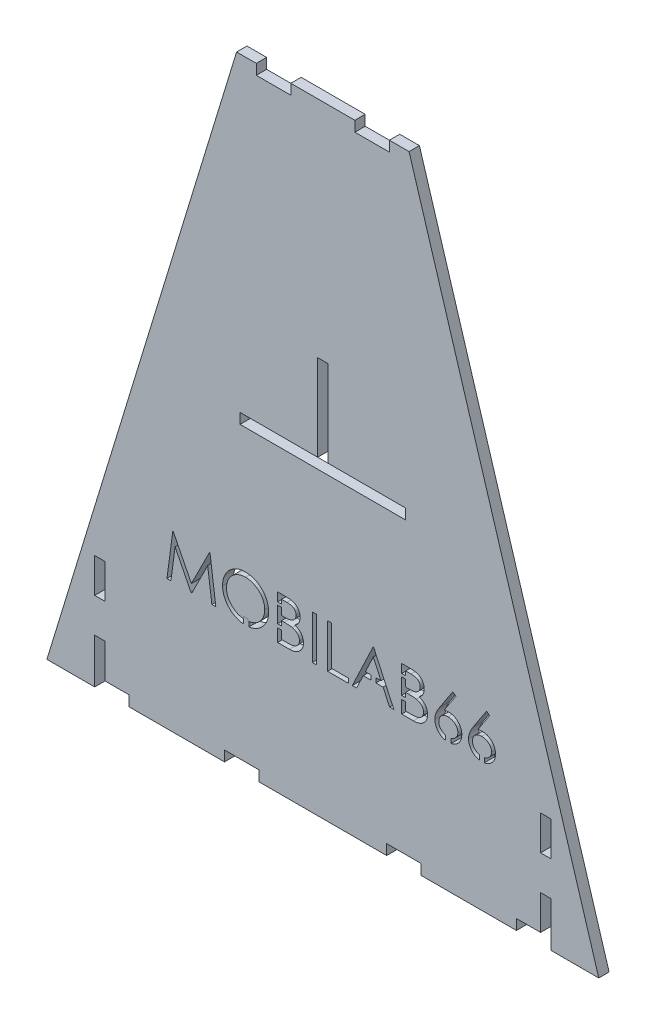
from build123d import *

# Parameters (mm, degrees)
BOSS_EXTRU_1_DEPTH      = 3
ESQUISSE2_W             = 3
ESQUISSE2_H             = 10
ENL_V_MAT_EXTRU_1_DEPTH = 202.578768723
ESQUISSE3_W             = 10
ESQUISSE3_H             = 3
ENL_V_MAT_EXTRU_2_DEPTH = 120
ESQUISSE4_W             = 1.13974359
ESQUISSE4_H             = 12.7
ENL_V_MAT_EXTRU_3_DEPTH = 3
ESQUISSE5_W             = 1.13974359
ESQUISSE5_H             = 0.825755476
ESQUISSE5_H_2           = 1.029626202
ESQUISSE5_W_2           = 1.139743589
ESQUISSE5_W_3           = 1.442397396
ESQUISSE5_H_3           = 1.302564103
ESQUISSE5_W_4           = 1.640062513
ESQUISSE5_H_4           = 2.510990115
ESQUISSE5_W_5           = 1.357293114
ESQUISSE5_W_6           = 1.601092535
ESQUISSE5_H_5           = 2.843057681
BOSS_EXTRU_2_DEPTH      = 3


with BuildPart() as part:
    # Esquisse1 → Boss.-Extru.1 (new body)
    with BuildSketch(Plane.XY):
        Polygon((-80, 5), (-66.130511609, 5), (-66.130511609, 8), (-56.130511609, 8), (-56.130511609, 5), (-28.511151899, 5), (-28.511151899, 8), (-18.511151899, 8), (-18.511151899, 5), (18.511151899, 5), (18.511151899, 8), (28.511151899, 8), (28.511151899, 5), (56.130511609, 5), (56.130511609, 8), (66.130511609, 8), (66.130511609, 5), (80, 5), (25, 185), (-25, 185), align=None)
        Polygon((-1.5, 120), (1.5, 120), (1.5, 95), (24, 95), (24, 92), (-24, 92), (-24, 95), (-1.5, 95), align=None, mode=Mode.SUBTRACT)
    extrude(amount=BOSS_EXTRU_1_DEPTH)

    # Esquisse2 → Enl_v. mat.-Extru.1 (cut, through all)
    with BuildSketch(Plane.XY.offset(3)):
        with Locations((-64.630511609, 13)):
            Rectangle(ESQUISSE2_W, ESQUISSE2_H)
        with Locations((-64.630511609, 33)):
            Rectangle(ESQUISSE2_W, ESQUISSE2_H)
        with Locations((64.630511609, 33)):
            Rectangle(ESQUISSE2_W, ESQUISSE2_H)
        with Locations((64.630511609, 13)):
            Rectangle(ESQUISSE2_W, ESQUISSE2_H)
    extrude(amount=-ENL_V_MAT_EXTRU_1_DEPTH, mode=Mode.SUBTRACT)

    # Esquisse3 → Enl_v. mat.-Extru.2 (cut)
    with BuildSketch(Plane.XY.offset(3)):
        with Locations((-14.289961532, 183.5)):
            Rectangle(ESQUISSE3_W, ESQUISSE3_H)
        with Locations((14.289961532, 183.5)):
            Rectangle(ESQUISSE3_W, ESQUISSE3_H)
    extrude(amount=-ENL_V_MAT_EXTRU_2_DEPTH, mode=Mode.SUBTRACT)

    # Esquisse4 → Enl_v. mat.-Extru.3 (cut)
    # profile 1 of 9: a face of its own
    with BuildSketch(Plane.XY.offset(3)):
        Polygon((-45.186989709, 42.699842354), (-43.510447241, 55.399842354), (-43.347626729, 55.399842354), (-38.104297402, 44.979329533), (-32.873688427, 55.399842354), (-32.708323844, 55.399842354), (-31.021605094, 42.699842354), (-32.166436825, 42.699842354), (-33.38250253, 51.838143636), (-37.966917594, 42.699842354), (-38.223868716, 42.699842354), (-42.826092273, 51.8584962), (-44.039613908, 42.699842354), align=None)
    # profile 2 of 9: a face of its own
    with BuildSketch(Plane.XY.offset(3)):
        with BuildLine():
            add(Edge.make_bspline(
                [(-22.473528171, 55.725483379), (-22.238367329, 55.719527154), (-21.776492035, 55.707828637), (-21.097677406, 55.618278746), (-20.449632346, 55.463355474), (-19.827077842, 55.257024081), (-19.23746047, 54.981781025), (-18.676342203, 54.649094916), (-18.145058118, 54.255480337), (-17.650769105, 53.803979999), (-17.198442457, 53.312731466), (-16.799931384, 52.78848305), (-16.465949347, 52.234404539), (-16.191680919, 51.652160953), (-15.976511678, 51.043069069), (-15.828034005, 50.403881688), (-15.733189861, 49.73874027), (-15.722101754, 49.285071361), (-15.716476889, 49.054930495)],
                knots=[0, 0, 0, 0, 1.065120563, 2.091984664, 3.0946048, 4.079830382, 5.057816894, 6.036188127, 7.030412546, 8.04752943, 9.064399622, 10.05169764, 11.02544977, 11.989514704, 12.962713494, 13.945757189, 14.957906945, 16, 16, 16, 16], degree=3))
            add(Edge.make_bspline(
                [(-15.716476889, 49.054930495), (-15.72210093, 48.826484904), (-15.733186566, 48.376192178), (-15.828141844, 47.715271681), (-15.977062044, 47.079942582), (-16.189682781, 46.471265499), (-16.462643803, 45.888598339), (-16.79884971, 45.333474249), (-17.194876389, 44.805711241), (-17.64556982, 44.311090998), (-18.136882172, 43.857528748), (-18.663860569, 43.462308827), (-19.214653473, 43.122224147), (-19.796348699, 42.850866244), (-20.40123169, 42.633979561), (-21.03471612, 42.486105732), (-21.693833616, 42.390721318), (-22.143308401, 42.379768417), (-22.37176535, 42.374201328)],
                knots=[0, 0, 0, 0, 1.043624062, 2.057103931, 3.04512605, 4.022047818, 4.998200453, 5.980619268, 6.982898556, 8.009068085, 9.034988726, 10.034168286, 11.015286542, 11.987931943, 12.962482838, 13.94673481, 14.956375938, 16, 16, 16, 16], degree=3))
            add(Edge.make_bspline(
                [(-22.37176535, 42.374201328), (-22.601905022, 42.379823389), (-23.055571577, 42.390905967), (-23.72154882, 42.485907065), (-24.361185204, 42.63446551), (-24.972651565, 42.846771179), (-25.556288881, 43.121153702), (-26.113238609, 43.455723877), (-26.641265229, 43.852715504), (-27.135990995, 44.303262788), (-27.588652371, 44.79374242), (-27.983293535, 45.31928386), (-28.317938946, 45.869576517), (-28.591400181, 46.446147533), (-28.807896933, 47.046209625), (-28.955597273, 47.673765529), (-29.051159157, 48.32523745), (-29.062171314, 48.768804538), (-29.06775894, 48.993872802)],
                knots=[0, 0, 0, 0, 1.053102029, 2.075944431, 3.073151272, 4.055350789, 5.033113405, 6.020478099, 7.024410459, 8.052272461, 9.079885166, 10.07527673, 11.055994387, 12.023226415, 12.992069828, 13.970394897, 14.97016774, 16, 16, 16, 16], degree=3))
            add(Edge.make_bspline(
                [(-29.06775894, 48.993872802), (-29.065818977, 49.144939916), (-29.061963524, 49.445168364), (-29.015547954, 49.890998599), (-28.948195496, 50.329658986), (-28.851668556, 50.75990214), (-28.725424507, 51.180674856), (-28.576464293, 51.594879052), (-28.394528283, 51.998317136), (-28.188858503, 52.3929003), (-27.959308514, 52.772477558), (-27.705759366, 53.131269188), (-27.437116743, 53.472285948), (-27.142609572, 53.786690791), (-26.831944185, 54.083630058), (-26.500080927, 54.358540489), (-26.149044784, 54.613901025), (-25.777325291, 54.844026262), (-25.394081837, 55.05215798), (-24.999014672, 55.230762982), (-24.597489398, 55.384055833), (-24.18762539, 55.508301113), (-23.770511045, 55.606388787), (-23.345235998, 55.673181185), (-22.912139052, 55.719715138), (-22.620360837, 55.72355236), (-22.473528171, 55.725483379)],
                knots=[0, 0, 0, 0, 1.037015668, 2.060948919, 3.074880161, 4.083647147, 5.086022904, 6.090072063, 7.104153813, 8.122640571, 9.144368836, 10.147691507, 11.138137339, 12.123020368, 13.103399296, 14.087645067, 15.080126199, 16.082011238, 17.087798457, 18.072939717, 19.057185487, 20.037253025, 21.01195951, 21.997135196, 22.992090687, 24, 24, 24, 24], degree=3))
        make_face()
        with BuildLine():
            add(Edge.make_bspline(
                [(-22.41755862, 54.422919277), (-22.53808029, 54.421450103), (-22.777971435, 54.418525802), (-23.134603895, 54.38000592), (-23.486546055, 54.325106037), (-23.833870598, 54.246795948), (-24.175124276, 54.140101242), (-24.513487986, 54.017307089), (-24.84587621, 53.867733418), (-25.171191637, 53.698741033), (-25.486569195, 53.511692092), (-25.784158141, 53.304965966), (-26.064728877, 53.083410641), (-26.327594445, 52.846509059), (-26.571982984, 52.59305479), (-26.802704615, 52.326890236), (-27.010511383, 52.04040766), (-27.200959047, 51.741375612), (-27.37138521, 51.430183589), (-27.522933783, 51.110107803), (-27.646900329, 50.77853734), (-27.748000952, 50.439069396), (-27.831820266, 50.092241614), (-27.884920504, 49.735422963), (-27.923863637, 49.370406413), (-27.926620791, 49.1237294), (-27.92801535, 48.998960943)],
                knots=[0, 0, 0, 0, 1.008559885, 2.007477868, 2.99961109, 3.989939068, 4.984837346, 5.991145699, 7.001802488, 8.033829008, 9.059044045, 10.069351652, 11.065060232, 12.050310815, 13.029377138, 14.011219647, 14.996725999, 15.989392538, 16.977580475, 17.965360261, 18.951710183, 19.937753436, 20.929683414, 21.935841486, 22.955955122, 24, 24, 24, 24], degree=3))
            add(Edge.make_bspline(
                [(-27.92801535, 48.998960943), (-27.923389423, 48.815492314), (-27.914288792, 48.454552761), (-27.83461418, 47.925622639), (-27.71188873, 47.417302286), (-27.530977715, 46.932373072), (-27.304734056, 46.466666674), (-27.025236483, 46.024314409), (-26.694096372, 45.605196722), (-26.317945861, 45.212239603), (-25.906746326, 44.853570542), (-25.47011042, 44.538743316), (-25.012715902, 44.272368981), (-24.533369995, 44.055362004), (-24.034631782, 43.883404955), (-23.513287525, 43.765553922), (-22.972810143, 43.687991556), (-22.604398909, 43.680542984), (-22.41755862, 43.676765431)],
                knots=[0, 0, 0, 0, 1.032063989, 2.030389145, 3.003944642, 3.970395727, 4.937377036, 5.913328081, 6.909231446, 7.93887556, 8.970685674, 9.976071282, 10.964166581, 11.944589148, 12.933237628, 13.927779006, 14.949070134, 16, 16, 16, 16], degree=3))
            add(Edge.make_bspline(
                [(-22.41755862, 43.676765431), (-22.291975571, 43.678490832), (-22.042906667, 43.681912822), (-21.672445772, 43.716379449), (-21.308658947, 43.771649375), (-20.952056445, 43.851226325), (-20.603042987, 43.950820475), (-20.260161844, 44.069139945), (-19.927065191, 44.216754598), (-19.599550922, 44.379851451), (-19.286055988, 44.565780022), (-18.986787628, 44.76548988), (-18.709289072, 44.986718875), (-18.446620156, 45.220100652), (-18.201228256, 45.4703409), (-17.974772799, 45.737114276), (-17.76801632, 46.022104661), (-17.577640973, 46.320683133), (-17.407811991, 46.632726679), (-17.259842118, 46.953962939), (-17.13430764, 47.283600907), (-17.032967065, 47.622116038), (-16.953554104, 47.968865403), (-16.898835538, 48.324313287), (-16.860559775, 48.687748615), (-16.857674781, 48.933562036), (-16.856220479, 49.057474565)],
                knots=[0, 0, 0, 0, 1.047197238, 2.076906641, 3.100256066, 4.114471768, 5.12198147, 6.126382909, 7.136867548, 8.15857795, 9.17633901, 10.174870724, 11.156907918, 12.133735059, 13.104061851, 14.077631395, 15.04955518, 16.038496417, 17.029181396, 18.010275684, 18.986308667, 19.968651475, 20.955262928, 21.950658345, 22.966943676, 24, 24, 24, 24], degree=3))
            add(Edge.make_bspline(
                [(-16.856220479, 49.057474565), (-16.857675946, 49.180539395), (-16.860563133, 49.424661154), (-16.898817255, 49.785561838), (-16.953611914, 50.138452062), (-17.032579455, 50.481946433), (-17.134361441, 50.81613251), (-17.25986404, 51.140696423), (-17.407856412, 51.456847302), (-17.577703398, 51.763803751), (-17.768623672, 52.058352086), (-17.97724564, 52.339937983), (-18.207171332, 52.603273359), (-18.45183148, 52.854859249), (-18.717337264, 53.089329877), (-19.002485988, 53.306763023), (-19.303815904, 53.512406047), (-19.622866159, 53.6979188), (-19.952137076, 53.869239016), (-20.290007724, 54.01601837), (-20.632650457, 54.14074006), (-20.97919395, 54.247118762), (-21.332555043, 54.324799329), (-21.690346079, 54.380055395), (-22.052072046, 54.418512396), (-22.295343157, 54.421445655), (-22.41755862, 54.422919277)],
                knots=[0, 0, 0, 0, 1.02996197, 2.043119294, 3.035359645, 4.018872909, 4.991431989, 5.957985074, 6.929999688, 7.912076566, 8.892894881, 9.867085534, 10.843653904, 11.817741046, 12.803660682, 13.806313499, 14.818574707, 15.856120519, 16.894564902, 17.924820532, 18.937903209, 19.946497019, 20.957711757, 21.963978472, 22.977135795, 24, 24, 24, 24], degree=3))
        make_face(mode=Mode.SUBTRACT)
    # profile 3 of 9: a face of its own
    with BuildSketch(Plane.XY.offset(3)):
        with BuildLine():
            Line((-13.111348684, 55.399842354), (-10.633424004, 55.399842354))
            add(Edge.make_bspline(
                [(-10.633424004, 55.399842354), (-10.512126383, 55.399204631), (-10.277021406, 55.397968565), (-9.935139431, 55.378798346), (-9.614922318, 55.352659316), (-9.316277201, 55.311184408), (-9.039342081, 55.26113996), (-8.783282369, 55.200536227), (-8.548912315, 55.127868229), (-8.269103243, 55.012311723), (-7.950076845, 54.840596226), (-7.604642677, 54.586855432), (-7.30926158, 54.276494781), (-7.054585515, 53.926400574), (-6.852107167, 53.541279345), (-6.705624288, 53.130310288), (-6.612885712, 52.698794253), (-6.60334825, 52.402546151), (-6.598528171, 52.252827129)],
                knots=[0, 0, 0, 0, 1.001505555, 1.941167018, 2.826882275, 3.653841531, 4.429895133, 5.150066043, 5.825578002, 6.45369114, 7.647487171, 8.808567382, 9.977351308, 11.170798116, 12.373658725, 13.556498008, 14.765093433, 16, 16, 16, 16], degree=3))
            add(Edge.make_bspline(
                [(-6.598528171, 52.252827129), (-6.602494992, 52.11257357), (-6.61029017, 51.8369621), (-6.684831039, 51.433849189), (-6.801528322, 51.050123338), (-6.963744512, 50.687184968), (-7.174571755, 50.353234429), (-7.424429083, 50.045577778), (-7.725879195, 49.777241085), (-7.951733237, 49.62722541), (-8.066456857, 49.551024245)],
                knots=[0, 0, 0, 0, 1.044552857, 2.05264487, 3.044412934, 4.028983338, 5.005914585, 5.980388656, 6.974128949, 8, 8, 8, 8], degree=3))
            add(Edge.make_bspline(
                [(-8.066456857, 49.551024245), (-7.922183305, 49.495634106), (-7.646152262, 49.389659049), (-7.266291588, 49.202296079), (-6.939013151, 48.99850785), (-6.661800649, 48.775960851), (-6.424718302, 48.536080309), (-6.217697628, 48.275348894), (-6.041053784, 47.990365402), (-5.889695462, 47.684101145), (-5.771589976, 47.359683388), (-5.683140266, 47.020155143), (-5.632458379, 46.6667339), (-5.62524608, 46.426212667), (-5.621605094, 46.30479027)],
                knots=[0, 0, 0, 0, 1.27268992, 2.434971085, 3.483601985, 4.442670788, 5.356604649, 6.2567628, 7.179492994, 8.113709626, 9.066344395, 10.018646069, 10.999752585, 12, 12, 12, 12], degree=3))
            add(Edge.make_bspline(
                [(-5.621605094, 46.30479027), (-5.625149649, 46.180813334), (-5.632123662, 45.936885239), (-5.683576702, 45.57854518), (-5.770695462, 45.236098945), (-5.890696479, 44.907331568), (-6.04731402, 44.59287908), (-6.237915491, 44.292385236), (-6.465178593, 44.008869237), (-6.719406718, 43.739180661), (-7.007015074, 43.496691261), (-7.317315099, 43.280734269), (-7.654214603, 43.103129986), (-8.01218041, 42.953937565), (-8.395228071, 42.839974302), (-8.801637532, 42.760245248), (-9.231058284, 42.706524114), (-9.525733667, 42.702107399), (-9.676853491, 42.699842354)],
                knots=[0, 0, 0, 0, 0.978564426, 1.925352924, 2.850884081, 3.763762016, 4.682927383, 5.618979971, 6.567305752, 7.547517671, 8.540179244, 9.531824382, 10.526200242, 11.540722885, 12.589160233, 13.674978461, 14.80764778, 16, 16, 16, 16], degree=3))
            Line((-9.676853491, 42.699842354), (-13.111348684, 42.699842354))
            Line((-13.111348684, 42.699842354), (-13.111348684, 55.399842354))
        make_face()
        with BuildLine():
            Line((-11.971605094, 54.097278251), (-11.971605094, 50.026765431))
            Line((-11.971605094, 50.026765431), (-11.20583987, 50.026765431))
            add(Edge.make_bspline(
                [(-11.20583987, 50.026765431), (-11.093902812, 50.02821658), (-10.877617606, 50.031020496), (-10.564399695, 50.0390524), (-10.273660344, 50.061542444), (-10.005901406, 50.084026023), (-9.761544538, 50.120582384), (-9.541131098, 50.164096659), (-9.341201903, 50.210117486), (-9.110644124, 50.28838391), (-8.849122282, 50.404054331), (-8.570327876, 50.583566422), (-8.324548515, 50.797377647), (-8.117004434, 51.044087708), (-7.947145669, 51.315745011), (-7.829167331, 51.60801512), (-7.749167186, 51.913613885), (-7.741940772, 52.123411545), (-7.738271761, 52.229930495)],
                knots=[0, 0, 0, 0, 1.156816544, 2.235205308, 3.236616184, 4.169592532, 5.011045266, 5.787822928, 6.49130361, 7.128639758, 8.301311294, 9.436451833, 10.541879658, 11.654887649, 12.756523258, 13.837046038, 14.901820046, 16, 16, 16, 16], degree=3))
            add(Edge.make_bspline(
                [(-7.738271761, 52.229930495), (-7.740181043, 52.300418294), (-7.743926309, 52.43868781), (-7.774599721, 52.640252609), (-7.826733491, 52.829822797), (-7.893696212, 53.009996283), (-7.987272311, 53.175139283), (-8.097448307, 53.330961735), (-8.230564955, 53.472157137), (-8.382084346, 53.604126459), (-8.556287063, 53.721128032), (-8.753069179, 53.823601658), (-8.975093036, 53.906118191), (-9.218616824, 53.978385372), (-9.487389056, 54.029142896), (-9.77830815, 54.071428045), (-10.093756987, 54.092955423), (-10.311997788, 54.095805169), (-10.424810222, 54.097278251)],
                knots=[0, 0, 0, 0, 0.91205012, 1.789085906, 2.630437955, 3.453916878, 4.269457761, 5.079663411, 5.91843418, 6.774407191, 7.675494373, 8.627863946, 9.638891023, 10.736472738, 11.911756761, 13.175263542, 14.539845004, 16, 16, 16, 16], degree=3))
            Line((-10.424810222, 54.097278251), (-11.971605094, 54.097278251))
        make_face(mode=Mode.SUBTRACT)
        with BuildLine():
            Line((-11.971605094, 48.724201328), (-11.971605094, 44.002406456))
            Line((-11.971605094, 44.002406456), (-10.348488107, 44.002406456))
            add(Edge.make_bspline(
                [(-10.348488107, 44.002406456), (-10.232305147, 44.003798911), (-10.008377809, 44.006482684), (-9.685067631, 44.015244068), (-9.38540894, 44.035173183), (-9.110769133, 44.066545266), (-8.858182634, 44.100575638), (-8.63067954, 44.146336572), (-8.426415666, 44.198765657), (-8.189563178, 44.279806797), (-7.922850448, 44.40570542), (-7.635428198, 44.595531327), (-7.379881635, 44.821675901), (-7.16287398, 45.083408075), (-6.98502685, 45.368001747), (-6.855648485, 45.669700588), (-6.77585309, 45.983519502), (-6.766193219, 46.19748443), (-6.761348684, 46.30479027)],
                knots=[0, 0, 0, 0, 1.160039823, 2.235823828, 3.228722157, 4.157150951, 4.99529583, 5.772374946, 6.472645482, 7.099169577, 8.269452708, 9.405989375, 10.527446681, 11.663510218, 12.788923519, 13.866172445, 14.929861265, 16, 16, 16, 16], degree=3))
            add(Edge.make_bspline(
                [(-6.761348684, 46.30479027), (-6.762350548, 46.371894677), (-6.764338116, 46.505021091), (-6.794312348, 46.700658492), (-6.837905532, 46.890163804), (-6.89426245, 47.074051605), (-6.976338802, 47.248997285), (-7.072156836, 47.418460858), (-7.184502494, 47.582666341), (-7.359559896, 47.790265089), (-7.614183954, 48.029449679), (-7.97597711, 48.263628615), (-8.387356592, 48.452487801), (-8.685724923, 48.53267733), (-8.839854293, 48.574101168)],
                knots=[0, 0, 0, 0, 0.723448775, 1.435228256, 2.130040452, 2.821711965, 3.505591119, 4.210454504, 4.921174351, 5.648778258, 7.137944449, 8.670945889, 10.280296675, 12, 12, 12, 12], degree=3))
            add(Edge.make_bspline(
                [(-8.839854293, 48.574101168), (-8.901645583, 48.586638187), (-9.035621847, 48.61382103), (-9.254089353, 48.642514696), (-9.503502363, 48.668078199), (-9.784436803, 48.686987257), (-10.097248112, 48.706532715), (-10.44260436, 48.714133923), (-10.819095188, 48.723202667), (-11.080324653, 48.723859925), (-11.216016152, 48.724201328)],
                knots=[0, 0, 0, 0, 0.634451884, 1.375622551, 2.216452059, 3.157844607, 4.20941857, 5.370758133, 6.634282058, 8, 8, 8, 8], degree=3))
            Line((-11.216016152, 48.724201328), (-11.971605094, 48.724201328))
        make_face(mode=Mode.SUBTRACT)
    # profile 4 of 9: a face of its own
    with BuildSketch(Plane.XY.offset(3)):
        with Locations((-2.446605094, 49.049842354)):
            Rectangle(ESQUISSE4_W, ESQUISSE4_H)
    # profile 5 of 9: a face of its own
    with BuildSketch(Plane.XY.offset(3)):
        Polygon((1.379676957, 55.399842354), (2.519420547, 55.399842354), (2.519420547, 44.002406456), (7.404035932, 44.002406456), (7.404035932, 42.699842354), (1.379676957, 42.699842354), align=None)
    # profile 6 of 9: a face of its own
    with BuildSketch(Plane.XY.offset(3)):
        Polygon((14.730959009, 55.399842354), (20.59249747, 42.699842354), (19.35353513, 42.699842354), (17.476011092, 46.770355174), (11.718779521, 46.770355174), (9.787830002, 42.699842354), (8.543779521, 42.699842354), (14.568138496, 55.399842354), align=None)
        Polygon((14.6368284, 52.924461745), (12.336988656, 48.072919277), (16.875610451, 48.072919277), align=None, mode=Mode.SUBTRACT)
    # profile 7 of 9: a face of its own
    with BuildSketch(Plane.XY.offset(3)):
        with BuildLine():
            Line((22.87198465, 55.399842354), (25.349909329, 55.399842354))
            add(Edge.make_bspline(
                [(25.349909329, 55.399842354), (25.47120695, 55.399204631), (25.706311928, 55.397968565), (26.048193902, 55.378798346), (26.368411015, 55.352659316), (26.667056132, 55.311184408), (26.943991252, 55.26113996), (27.200050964, 55.200536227), (27.434421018, 55.127868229), (27.71423009, 55.012311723), (28.033256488, 54.840596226), (28.378690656, 54.586855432), (28.674071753, 54.276494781), (28.928747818, 53.926400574), (29.131226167, 53.541279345), (29.277709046, 53.130310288), (29.370447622, 52.698794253), (29.379985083, 52.402546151), (29.384805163, 52.252827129)],
                knots=[0, 0, 0, 0, 1.001505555, 1.941167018, 2.826882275, 3.653841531, 4.429895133, 5.150066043, 5.825578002, 6.45369114, 7.647487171, 8.808567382, 9.977351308, 11.170798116, 12.373658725, 13.556498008, 14.765093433, 16, 16, 16, 16], degree=3))
            add(Edge.make_bspline(
                [(29.384805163, 52.252827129), (29.380838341, 52.11257357), (29.373043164, 51.8369621), (29.298502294, 51.433849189), (29.181805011, 51.050123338), (29.019588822, 50.687184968), (28.808761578, 50.353234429), (28.55890425, 50.045577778), (28.257454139, 49.777241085), (28.031600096, 49.62722541), (27.916876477, 49.551024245)],
                knots=[0, 0, 0, 0, 1.044552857, 2.05264487, 3.044412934, 4.028983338, 5.005914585, 5.980388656, 6.974128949, 8, 8, 8, 8], degree=3))
            add(Edge.make_bspline(
                [(27.916876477, 49.551024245), (28.061150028, 49.495634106), (28.337181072, 49.389659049), (28.717041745, 49.202296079), (29.044320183, 48.99850785), (29.321532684, 48.775960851), (29.558615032, 48.536080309), (29.765635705, 48.275348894), (29.942279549, 47.990365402), (30.093637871, 47.684101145), (30.211743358, 47.359683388), (30.300193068, 47.020155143), (30.350874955, 46.6667339), (30.358087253, 46.426212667), (30.361728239, 46.30479027)],
                knots=[0, 0, 0, 0, 1.27268992, 2.434971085, 3.483601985, 4.442670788, 5.356604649, 6.2567628, 7.179492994, 8.113709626, 9.066344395, 10.018646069, 10.999752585, 12, 12, 12, 12], degree=3))
            add(Edge.make_bspline(
                [(30.361728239, 46.30479027), (30.358183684, 46.180813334), (30.351209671, 45.936885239), (30.299756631, 45.57854518), (30.212637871, 45.236098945), (30.092636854, 44.907331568), (29.936019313, 44.59287908), (29.745417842, 44.292385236), (29.51815474, 44.008869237), (29.263926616, 43.739180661), (28.976318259, 43.496691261), (28.666018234, 43.280734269), (28.329118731, 43.103129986), (27.971152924, 42.953937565), (27.588105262, 42.839974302), (27.181695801, 42.760245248), (26.752275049, 42.706524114), (26.457599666, 42.702107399), (26.306479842, 42.699842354)],
                knots=[0, 0, 0, 0, 0.978564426, 1.925352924, 2.850884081, 3.763762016, 4.682927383, 5.618979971, 6.567305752, 7.547517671, 8.540179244, 9.531824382, 10.526200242, 11.540722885, 12.589160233, 13.674978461, 14.80764778, 16, 16, 16, 16], degree=3))
            Line((26.306479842, 42.699842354), (22.87198465, 42.699842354))
            Line((22.87198465, 42.699842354), (22.87198465, 55.399842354))
        make_face()
        with BuildLine():
            Line((24.011728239, 54.097278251), (24.011728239, 50.026765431))
            Line((24.011728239, 50.026765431), (24.777493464, 50.026765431))
            add(Edge.make_bspline(
                [(24.777493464, 50.026765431), (24.889430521, 50.02821658), (25.105715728, 50.031020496), (25.418933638, 50.0390524), (25.70967299, 50.061542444), (25.977431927, 50.084026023), (26.221788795, 50.120582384), (26.442202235, 50.164096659), (26.64213143, 50.210117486), (26.87268921, 50.28838391), (27.134211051, 50.404054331), (27.413005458, 50.583566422), (27.658784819, 50.797377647), (27.8663289, 51.044087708), (28.036187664, 51.315745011), (28.154166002, 51.60801512), (28.234166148, 51.913613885), (28.241392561, 52.123411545), (28.245061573, 52.229930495)],
                knots=[0, 0, 0, 0, 1.156816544, 2.235205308, 3.236616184, 4.169592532, 5.011045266, 5.787822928, 6.49130361, 7.128639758, 8.301311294, 9.436451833, 10.541879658, 11.654887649, 12.756523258, 13.837046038, 14.901820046, 16, 16, 16, 16], degree=3))
            add(Edge.make_bspline(
                [(28.245061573, 52.229930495), (28.24315229, 52.300418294), (28.239407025, 52.43868781), (28.208733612, 52.640252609), (28.156599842, 52.829822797), (28.089637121, 53.009996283), (27.996061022, 53.175139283), (27.885885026, 53.330961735), (27.752768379, 53.472157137), (27.601248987, 53.604126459), (27.42704627, 53.721128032), (27.230264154, 53.823601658), (27.008240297, 53.906118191), (26.764716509, 53.978385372), (26.495944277, 54.029142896), (26.205025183, 54.071428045), (25.889576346, 54.092955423), (25.671335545, 54.095805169), (25.558523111, 54.097278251)],
                knots=[0, 0, 0, 0, 0.91205012, 1.789085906, 2.630437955, 3.453916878, 4.269457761, 5.079663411, 5.91843418, 6.774407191, 7.675494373, 8.627863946, 9.638891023, 10.736472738, 11.911756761, 13.175263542, 14.539845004, 16, 16, 16, 16], degree=3))
            Line((25.558523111, 54.097278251), (24.011728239, 54.097278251))
        make_face(mode=Mode.SUBTRACT)
        with BuildLine():
            Line((24.011728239, 48.724201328), (24.011728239, 44.002406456))
            Line((24.011728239, 44.002406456), (25.634845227, 44.002406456))
            add(Edge.make_bspline(
                [(25.634845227, 44.002406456), (25.751028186, 44.003798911), (25.974955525, 44.006482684), (26.298265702, 44.015244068), (26.597924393, 44.035173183), (26.8725642, 44.066545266), (27.1251507, 44.100575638), (27.352653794, 44.146336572), (27.556917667, 44.198765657), (27.793770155, 44.279806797), (28.060482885, 44.40570542), (28.347905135, 44.595531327), (28.603451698, 44.821675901), (28.820459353, 45.083408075), (28.998306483, 45.368001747), (29.127684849, 45.669700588), (29.207480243, 45.983519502), (29.217140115, 46.19748443), (29.22198465, 46.30479027)],
                knots=[0, 0, 0, 0, 1.160039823, 2.235823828, 3.228722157, 4.157150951, 4.99529583, 5.772374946, 6.472645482, 7.099169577, 8.269452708, 9.405989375, 10.527446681, 11.663510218, 12.788923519, 13.866172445, 14.929861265, 16, 16, 16, 16], degree=3))
            add(Edge.make_bspline(
                [(29.22198465, 46.30479027), (29.220982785, 46.371894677), (29.218995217, 46.505021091), (29.189020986, 46.700658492), (29.145427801, 46.890163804), (29.089070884, 47.074051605), (29.006994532, 47.248997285), (28.911176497, 47.418460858), (28.79883084, 47.582666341), (28.623773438, 47.790265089), (28.36914938, 48.029449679), (28.007356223, 48.263628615), (27.595976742, 48.452487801), (27.29760841, 48.53267733), (27.143479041, 48.574101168)],
                knots=[0, 0, 0, 0, 0.723448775, 1.435228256, 2.130040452, 2.821711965, 3.505591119, 4.210454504, 4.921174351, 5.648778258, 7.137944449, 8.670945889, 10.280296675, 12, 12, 12, 12], degree=3))
            add(Edge.make_bspline(
                [(27.143479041, 48.574101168), (27.08168775, 48.586638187), (26.947711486, 48.61382103), (26.72924398, 48.642514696), (26.47983097, 48.668078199), (26.19889653, 48.686987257), (25.886085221, 48.706532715), (25.540728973, 48.714133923), (25.164238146, 48.723202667), (24.90300868, 48.723859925), (24.767317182, 48.724201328)],
                knots=[0, 0, 0, 0, 0.634451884, 1.375622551, 2.216452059, 3.157844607, 4.20941857, 5.370758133, 6.634282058, 8, 8, 8, 8], degree=3))
            Line((24.767317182, 48.724201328), (24.011728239, 48.724201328))
        make_face(mode=Mode.SUBTRACT)
    # profile 8 of 9: a face of its own
    with BuildSketch(Plane.XY.offset(3)):
        with BuildLine():
            Line((37.688651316, 55.725483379), (38.566355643, 55.03604027))
            Line((38.566355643, 55.03604027), (35.210726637, 49.904650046))
            add(Edge.make_bspline(
                [(35.210726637, 49.904650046), (35.434138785, 49.94026034), (35.86992944, 50.009722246), (36.311039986, 50.021181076), (36.526011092, 50.026765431)],
                knots=[0, 0, 0, 0, 1.025318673, 2, 2, 2, 2], degree=3))
            add(Edge.make_bspline(
                [(36.526011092, 50.026765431), (36.655088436, 50.023296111), (36.909173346, 50.016466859), (37.282215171, 49.963911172), (37.640677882, 49.881088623), (37.983075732, 49.760357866), (38.310637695, 49.606135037), (38.625243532, 49.421299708), (38.920979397, 49.196307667), (39.201653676, 48.944974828), (39.456477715, 48.66660177), (39.682087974, 48.371231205), (39.871596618, 48.059170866), (40.025353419, 47.730578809), (40.144751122, 47.385961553), (40.231792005, 47.025760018), (40.283243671, 46.649725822), (40.290230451, 46.393990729), (40.293779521, 46.264085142)],
                knots=[0, 0, 0, 0, 1.04369286, 2.054478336, 3.041073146, 4.015093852, 4.984733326, 5.965804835, 6.960378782, 7.985147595, 9.009457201, 10.008161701, 10.986880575, 11.956520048, 12.937015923, 13.931873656, 14.949455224, 16, 16, 16, 16], degree=3))
            add(Edge.make_bspline(
                [(40.293779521, 46.264085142), (40.288615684, 46.086358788), (40.278454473, 45.736635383), (40.177203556, 45.227268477), (40.019869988, 44.742010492), (39.794980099, 44.288608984), (39.515644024, 43.867685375), (39.175002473, 43.494720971), (38.785136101, 43.162089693), (38.344312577, 42.883935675), (37.869902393, 42.656776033), (37.371510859, 42.49361644), (36.853978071, 42.393164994), (36.502715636, 42.380571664), (36.325029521, 42.374201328)],
                knots=[0, 0, 0, 0, 1.031375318, 2.029502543, 3.004789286, 3.987476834, 4.960371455, 5.9300674, 6.912260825, 7.929083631, 8.949397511, 9.960523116, 10.96833055, 12, 12, 12, 12], degree=3))
            add(Edge.make_bspline(
                [(36.325029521, 42.374201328), (36.154135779, 42.379746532), (35.815625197, 42.390730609), (35.3176662, 42.488578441), (34.839191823, 42.647172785), (34.383554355, 42.865664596), (33.961476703, 43.141646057), (33.583867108, 43.473886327), (33.252608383, 43.855283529), (32.976929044, 44.285778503), (32.758275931, 44.748384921), (32.59430106, 45.230756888), (32.498520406, 45.731136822), (32.485136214, 46.070339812), (32.478394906, 46.241188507)],
                knots=[0, 0, 0, 0, 1.012016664, 2.004627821, 2.994792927, 3.992885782, 4.990978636, 5.973936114, 6.964471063, 7.975201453, 8.993600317, 9.990122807, 10.98767138, 12, 12, 12, 12], degree=3))
            add(Edge.make_bspline(
                [(32.478394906, 46.241188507), (32.482681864, 46.371978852), (32.491435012, 46.639027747), (32.552552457, 47.043482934), (32.650758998, 47.45732543), (32.760741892, 47.808404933), (32.876949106, 48.096011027), (32.973659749, 48.327889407), (33.094033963, 48.566508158), (33.222388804, 48.820049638), (33.370278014, 49.081979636), (33.531080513, 49.356675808), (33.709242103, 49.639769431), (33.834138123, 49.831881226), (33.897986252, 49.930090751)],
                knots=[0, 0, 0, 0, 1.173818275, 2.396712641, 3.66331629, 4.989737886, 5.693666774, 6.447286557, 7.243889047, 8.091586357, 8.998013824, 9.943181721, 10.948533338, 12, 12, 12, 12], degree=3))
            Line((33.897986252, 49.930090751), (37.688651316, 55.725483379))
        make_face()
        with BuildLine():
            add(Edge.make_bspline(
                [(36.286868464, 48.724201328), (36.190122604, 48.721378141), (36.001149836, 48.715863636), (35.723900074, 48.683840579), (35.461506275, 48.623537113), (35.210492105, 48.546733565), (34.97555044, 48.441131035), (34.754973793, 48.312854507), (34.547909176, 48.161829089), (34.356525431, 47.990194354), (34.183008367, 47.802277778), (34.033579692, 47.601002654), (33.904684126, 47.391219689), (33.799884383, 47.17117607), (33.718277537, 46.940955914), (33.659247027, 46.701618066), (33.626394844, 46.451557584), (33.620929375, 46.28198536), (33.618138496, 46.195395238)],
                knots=[0, 0, 0, 0, 1.129588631, 2.206414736, 3.251139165, 4.268635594, 5.265702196, 6.250456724, 7.242448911, 8.251968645, 9.246821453, 10.222880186, 11.173611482, 12.116736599, 13.062300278, 14.020270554, 14.989073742, 16, 16, 16, 16], degree=3))
            add(Edge.make_bspline(
                [(33.618138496, 46.195395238), (33.620411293, 46.109579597), (33.624867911, 45.9413079), (33.6653349, 45.693334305), (33.727147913, 45.454701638), (33.819097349, 45.226640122), (33.928777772, 45.005673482), (34.073577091, 44.799805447), (34.234020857, 44.596532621), (34.42580513, 44.411470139), (34.631629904, 44.239270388), (34.851525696, 44.088756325), (35.080706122, 43.959992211), (35.322265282, 43.859077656), (35.572775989, 43.776258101), (35.834325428, 43.717977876), (36.107095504, 43.685028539), (36.291869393, 43.679555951), (36.386087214, 43.676765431)],
                knots=[0, 0, 0, 0, 0.989467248, 1.94019797, 2.891935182, 3.827694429, 4.772920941, 5.730924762, 6.725747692, 7.756678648, 8.79901574, 9.819492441, 10.826891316, 11.826466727, 12.835195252, 13.867842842, 14.912794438, 16, 16, 16, 16], degree=3))
            add(Edge.make_bspline(
                [(36.386087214, 43.676765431), (36.48030488, 43.67955617), (36.665078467, 43.685029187), (36.937850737, 43.717975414), (37.199392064, 43.776267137), (37.449932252, 43.859044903), (37.691382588, 43.960113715), (37.920362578, 44.087955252), (38.138178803, 44.240196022), (38.344138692, 44.411175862), (38.535124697, 44.597585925), (38.699416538, 44.797990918), (38.839781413, 45.007337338), (38.953842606, 45.225769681), (39.044779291, 45.454839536), (39.106905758, 45.693297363), (39.147289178, 45.941317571), (39.151757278, 46.109582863), (39.154035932, 46.195395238)],
                knots=[0, 0, 0, 0, 1.087397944, 2.132534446, 3.165364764, 4.174271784, 5.174024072, 6.181601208, 7.194203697, 8.236725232, 9.267838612, 10.269026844, 11.221737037, 12.171628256, 13.107553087, 14.05945871, 15.010357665, 16, 16, 16, 16], degree=3))
            add(Edge.make_bspline(
                [(39.154035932, 46.195395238), (39.152039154, 46.282098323), (39.14812013, 46.452268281), (39.103793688, 46.70150621), (39.042317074, 46.942171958), (38.94948722, 47.172752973), (38.828886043, 47.392339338), (38.681989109, 47.60204029), (38.512053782, 47.80346355), (38.315756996, 47.990562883), (38.102069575, 48.161639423), (37.874864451, 48.312658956), (37.63716409, 48.440112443), (37.389209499, 48.546455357), (37.12815961, 48.623197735), (36.858228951, 48.683625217), (36.575965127, 48.715781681), (36.384461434, 48.721359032), (36.286868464, 48.724201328)],
                knots=[0, 0, 0, 0, 0.978206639, 1.919901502, 2.851605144, 3.780102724, 4.718870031, 5.675451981, 6.667674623, 7.690630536, 8.733308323, 9.756129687, 10.767539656, 11.776269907, 12.797430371, 13.836405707, 14.897401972, 16, 16, 16, 16], degree=3))
        make_face(mode=Mode.SUBTRACT)
    # profile 9 of 9: a face of its own
    with BuildSketch(Plane.XY.offset(3)):
        with BuildLine():
            Line((47.457882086, 55.725483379), (48.335586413, 55.03604027))
            Line((48.335586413, 55.03604027), (44.979957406, 49.904650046))
            add(Edge.make_bspline(
                [(44.979957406, 49.904650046), (45.203369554, 49.94026034), (45.639160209, 50.009722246), (46.080270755, 50.021181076), (46.295241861, 50.026765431)],
                knots=[0, 0, 0, 0, 1.025318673, 2, 2, 2, 2], degree=3))
            add(Edge.make_bspline(
                [(46.295241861, 50.026765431), (46.424319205, 50.023296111), (46.678404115, 50.016466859), (47.05144594, 49.963911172), (47.409908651, 49.881088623), (47.752306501, 49.760357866), (48.079868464, 49.606135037), (48.394474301, 49.421299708), (48.690210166, 49.196307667), (48.970884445, 48.944974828), (49.225708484, 48.66660177), (49.451318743, 48.371231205), (49.640827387, 48.059170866), (49.794584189, 47.730578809), (49.913981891, 47.385961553), (50.001022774, 47.025760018), (50.05247444, 46.649725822), (50.05946122, 46.393990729), (50.063010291, 46.264085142)],
                knots=[0, 0, 0, 0, 1.04369286, 2.054478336, 3.041073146, 4.015093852, 4.984733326, 5.965804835, 6.960378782, 7.985147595, 9.009457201, 10.008161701, 10.986880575, 11.956520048, 12.937015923, 13.931873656, 14.949455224, 16, 16, 16, 16], degree=3))
            add(Edge.make_bspline(
                [(50.063010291, 46.264085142), (50.057846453, 46.086358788), (50.047685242, 45.736635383), (49.946434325, 45.227268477), (49.789100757, 44.742010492), (49.564210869, 44.288608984), (49.284874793, 43.867685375), (48.944233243, 43.494720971), (48.554366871, 43.162089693), (48.113543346, 42.883935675), (47.639133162, 42.656776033), (47.140741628, 42.49361644), (46.62320884, 42.393164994), (46.271946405, 42.380571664), (46.094260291, 42.374201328)],
                knots=[0, 0, 0, 0, 1.031375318, 2.029502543, 3.004789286, 3.987476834, 4.960371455, 5.9300674, 6.912260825, 7.929083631, 8.949397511, 9.960523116, 10.96833055, 12, 12, 12, 12], degree=3))
            add(Edge.make_bspline(
                [(46.094260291, 42.374201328), (45.923366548, 42.379746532), (45.584855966, 42.390730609), (45.08689697, 42.488578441), (44.608422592, 42.647172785), (44.152785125, 42.865664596), (43.730707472, 43.141646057), (43.353097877, 43.473886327), (43.021839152, 43.855283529), (42.746159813, 44.285778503), (42.5275067, 44.748384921), (42.363531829, 45.230756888), (42.267751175, 45.731136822), (42.254366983, 46.070339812), (42.247625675, 46.241188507)],
                knots=[0, 0, 0, 0, 1.012016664, 2.004627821, 2.994792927, 3.992885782, 4.990978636, 5.973936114, 6.964471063, 7.975201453, 8.993600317, 9.990122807, 10.98767138, 12, 12, 12, 12], degree=3))
            add(Edge.make_bspline(
                [(42.247625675, 46.241188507), (42.251912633, 46.371978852), (42.260665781, 46.639027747), (42.321783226, 47.043482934), (42.419989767, 47.45732543), (42.529972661, 47.808404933), (42.646179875, 48.096011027), (42.742890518, 48.327889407), (42.863264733, 48.566508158), (42.991619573, 48.820049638), (43.139508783, 49.081979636), (43.300311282, 49.356675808), (43.478472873, 49.639769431), (43.603368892, 49.831881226), (43.667217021, 49.930090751)],
                knots=[0, 0, 0, 0, 1.173818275, 2.396712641, 3.66331629, 4.989737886, 5.693666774, 6.447286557, 7.243889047, 8.091586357, 8.998013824, 9.943181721, 10.948533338, 12, 12, 12, 12], degree=3))
            Line((43.667217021, 49.930090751), (47.457882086, 55.725483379))
        make_face()
        with BuildLine():
            add(Edge.make_bspline(
                [(46.056099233, 48.724201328), (45.959353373, 48.721378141), (45.770380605, 48.715863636), (45.493130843, 48.683840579), (45.230737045, 48.623537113), (44.979722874, 48.546733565), (44.744781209, 48.441131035), (44.524204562, 48.312854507), (44.317139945, 48.161829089), (44.1257562, 47.990194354), (43.952239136, 47.802277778), (43.802810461, 47.601002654), (43.673914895, 47.391219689), (43.569115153, 47.17117607), (43.487508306, 46.940955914), (43.428477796, 46.701618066), (43.395625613, 46.451557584), (43.390160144, 46.28198536), (43.387369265, 46.195395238)],
                knots=[0, 0, 0, 0, 1.129588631, 2.206414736, 3.251139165, 4.268635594, 5.265702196, 6.250456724, 7.242448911, 8.251968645, 9.246821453, 10.222880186, 11.173611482, 12.116736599, 13.062300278, 14.020270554, 14.989073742, 16, 16, 16, 16], degree=3))
            add(Edge.make_bspline(
                [(43.387369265, 46.195395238), (43.389642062, 46.109579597), (43.39409868, 45.9413079), (43.434565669, 45.693334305), (43.496378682, 45.454701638), (43.588328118, 45.226640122), (43.698008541, 45.005673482), (43.84280786, 44.799805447), (44.003251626, 44.596532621), (44.195035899, 44.411470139), (44.400860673, 44.239270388), (44.620756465, 44.088756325), (44.849936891, 43.959992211), (45.091496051, 43.859077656), (45.342006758, 43.776258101), (45.603556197, 43.717977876), (45.876326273, 43.685028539), (46.061100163, 43.679555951), (46.155317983, 43.676765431)],
                knots=[0, 0, 0, 0, 0.989467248, 1.94019797, 2.891935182, 3.827694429, 4.772920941, 5.730924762, 6.725747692, 7.756678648, 8.79901574, 9.819492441, 10.826891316, 11.826466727, 12.835195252, 13.867842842, 14.912794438, 16, 16, 16, 16], degree=3))
            add(Edge.make_bspline(
                [(46.155317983, 43.676765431), (46.249535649, 43.67955617), (46.434309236, 43.685029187), (46.707081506, 43.717975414), (46.968622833, 43.776267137), (47.219163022, 43.859044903), (47.460613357, 43.960113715), (47.689593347, 44.087955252), (47.907409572, 44.240196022), (48.113369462, 44.411175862), (48.304355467, 44.597585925), (48.468647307, 44.797990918), (48.609012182, 45.007337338), (48.723073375, 45.225769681), (48.814010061, 45.454839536), (48.876136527, 45.693297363), (48.916519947, 45.941317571), (48.920988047, 46.109582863), (48.923266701, 46.195395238)],
                knots=[0, 0, 0, 0, 1.087397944, 2.132534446, 3.165364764, 4.174271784, 5.174024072, 6.181601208, 7.194203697, 8.236725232, 9.267838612, 10.269026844, 11.221737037, 12.171628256, 13.107553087, 14.05945871, 15.010357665, 16, 16, 16, 16], degree=3))
            add(Edge.make_bspline(
                [(48.923266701, 46.195395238), (48.921269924, 46.282098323), (48.917350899, 46.452268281), (48.873024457, 46.70150621), (48.811547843, 46.942171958), (48.718717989, 47.172752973), (48.598116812, 47.392339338), (48.451219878, 47.60204029), (48.281284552, 47.80346355), (48.084987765, 47.990562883), (47.871300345, 48.161639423), (47.644095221, 48.312658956), (47.406394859, 48.440112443), (47.158440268, 48.546455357), (46.897390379, 48.623197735), (46.62745972, 48.683625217), (46.345195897, 48.715781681), (46.153692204, 48.721359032), (46.056099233, 48.724201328)],
                knots=[0, 0, 0, 0, 0.978206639, 1.919901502, 2.851605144, 3.780102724, 4.718870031, 5.675451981, 6.667674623, 7.690630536, 8.733308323, 9.756129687, 10.767539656, 11.776269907, 12.797430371, 13.836405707, 14.897401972, 16, 16, 16, 16], degree=3))
        make_face(mode=Mode.SUBTRACT)
    extrude(amount=-ENL_V_MAT_EXTRU_3_DEPTH, mode=Mode.SUBTRACT)


with BuildPart() as enl_v_mat_extru_3_piece_1:
    # of the separate pieces the step leaves, piece 1, a body of its own (enl_v_mat_extru_3_pieces)
    add(part.part.solids().sort_by_distance((-80, 5, 0))[0])



with BuildPart() as enl_v_mat_extru_3_piece_2:
    # of the separate pieces the step leaves, piece 2, a body of its own (enl_v_mat_extru_3_pieces)
    add(part.part.solids().sort_by_distance((-16.856220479, 49.057474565, 0))[0])


with BuildPart() as enl_v_mat_extru_3_piece_3:
    # of the separate pieces the step leaves, piece 3, a body of its own (enl_v_mat_extru_3_pieces)
    add(part.part.solids().sort_by_distance((39.154035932, 46.195395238, 0))[0])


with BuildPart() as enl_v_mat_extru_3_piece_4:
    # of the separate pieces the step leaves, piece 4, a body of its own (enl_v_mat_extru_3_pieces)
    add(part.part.solids().sort_by_distance((48.923266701, 46.195395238, 0))[0])


with BuildPart() as enl_v_mat_extru_3_piece_5:
    # of the separate pieces the step leaves, piece 5, a body of its own (enl_v_mat_extru_3_pieces)
    add(part.part.solids().sort_by_distance((24.767317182, 48.724201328, 0))[0])


with BuildPart() as enl_v_mat_extru_3_piece_6:
    # of the separate pieces the step leaves, piece 6, a body of its own (enl_v_mat_extru_3_pieces)
    add(part.part.solids().sort_by_distance((-11.216016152, 48.724201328, 0))[0])


with BuildPart() as enl_v_mat_extru_3_piece_7:
    # of the separate pieces the step leaves, piece 7, a body of its own (enl_v_mat_extru_3_pieces)
    add(part.part.solids().sort_by_distance((-10.424810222, 54.097278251, 0))[0])


with BuildPart() as enl_v_mat_extru_3_piece_8:
    # of the separate pieces the step leaves, piece 8, a body of its own (enl_v_mat_extru_3_pieces)
    add(part.part.solids().sort_by_distance((25.558523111, 54.097278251, 0))[0])


with BuildPart() as enl_v_mat_extru_3_piece_9:
    # of the separate pieces the step leaves, piece 9, a body of its own (enl_v_mat_extru_3_pieces)
    add(part.part.solids().sort_by_distance((16.875610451, 48.072919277, 0))[0])


with BuildPart() as enl_v_mat_extru_3_piece_1_1:
    add(enl_v_mat_extru_3_piece_1.part)

    add(enl_v_mat_extru_3_piece_7.part)  # Boss.-Extru.2 merges Enl_v. mat.-Extru.3 piece 7

    add(enl_v_mat_extru_3_piece_6.part)  # Boss.-Extru.2 merges Enl_v. mat.-Extru.3 piece 6

    add(enl_v_mat_extru_3_piece_8.part)  # Boss.-Extru.2 merges Enl_v. mat.-Extru.3 piece 8

    add(enl_v_mat_extru_3_piece_5.part)  # Boss.-Extru.2 merges Enl_v. mat.-Extru.3 piece 5

    add(enl_v_mat_extru_3_piece_9.part)  # Boss.-Extru.2 merges Enl_v. mat.-Extru.3 piece 9

    add(enl_v_mat_extru_3_piece_3.part)  # Boss.-Extru.2 merges Enl_v. mat.-Extru.3 piece 3

    add(enl_v_mat_extru_3_piece_4.part)  # Boss.-Extru.2 merges Enl_v. mat.-Extru.3 piece 4
    # Esquisse5 → Boss.-Extru.2 (add)
    with BuildSketch(Plane.XY.offset(3)):
        with Locations((-12.541476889, 52.474899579)):
            Rectangle(ESQUISSE5_W, ESQUISSE5_H)
        with Locations((-12.541476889, 46.878116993)):
            Rectangle(ESQUISSE5_W, ESQUISSE5_H_2)
        with Locations((23.441856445, 52.474899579)):
            Rectangle(ESQUISSE5_W_2, ESQUISSE5_H)
        with Locations((23.441856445, 46.878116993)):
            Rectangle(ESQUISSE5_W_2, ESQUISSE5_H_2)
        with Locations((14.665872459, 47.421637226)):
            Rectangle(ESQUISSE5_W_3, ESQUISSE5_H_3)
        with Locations((36.376167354, 42.746911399)):
            Rectangle(ESQUISSE5_W_4, ESQUISSE5_H_4)
        with Locations((46.131711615, 42.746911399)):
            Rectangle(ESQUISSE5_W_5, ESQUISSE5_H_4)
        with Locations((-22.222140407, 42.912945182)):
            Rectangle(ESQUISSE5_W_6, ESQUISSE5_H_5)
    extrude(amount=-BOSS_EXTRU_2_DEPTH)


solid = Compound([enl_v_mat_extru_3_piece_2.part, enl_v_mat_extru_3_piece_1_1.part])
